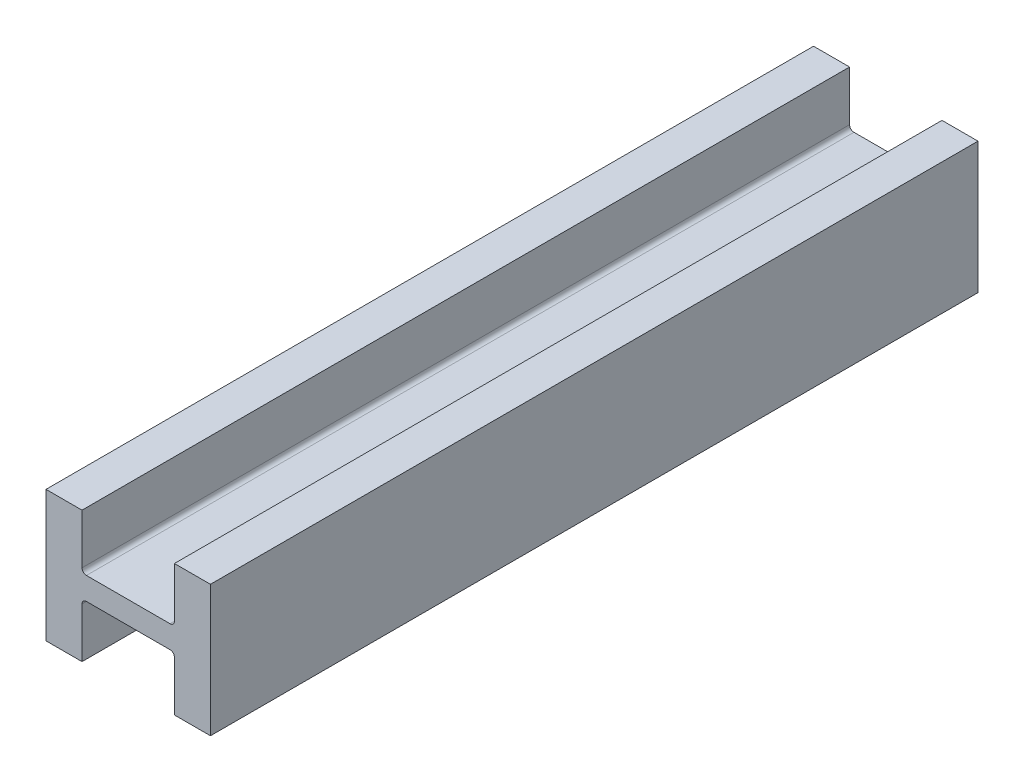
from build123d import *

# Parameters (mm, degrees)
BEAM_BODY_DEPTH = 1329.05


with BuildPart() as part:
    # sk W14x730 → Beam Body (new, symmetric)
    with BuildSketch(Plane(origin=(0, 0, 0), x_dir=(0, 1, 0), z_dir=(0, 0, 1))):
        with BuildLine():
            Line((-227.203, -284.734), (-227.203, -160.02))
            Line((-227.203, -160.02), (-54.229, -160.02))
            ThreePointArc((-54.229, -160.02), (-43.452692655, -155.556307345), (-38.989, -144.78))
            Line((-38.989, -144.78), (-38.989, 144.78))
            ThreePointArc((-38.989, 144.78), (-43.452692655, 155.556307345), (-54.229, 160.02))
            Line((-54.229, 160.02), (-227.203, 160.02))
            Line((-227.203, 160.02), (-227.203, 284.734))
            Line((-227.203, 284.734), (227.203, 284.734))
            Line((227.203, 284.734), (227.203, 160.02))
            Line((227.203, 160.02), (54.229, 160.02))
            ThreePointArc((54.229, 160.02), (43.452692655, 155.556307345), (38.989, 144.78))
            Line((38.989, 144.78), (38.989, -144.78))
            ThreePointArc((38.989, -144.78), (43.452692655, -155.556307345), (54.229, -160.02))
            Line((54.229, -160.02), (227.203, -160.02))
            Line((227.203, -160.02), (227.203, -284.734))
            Line((227.203, -284.734), (-227.203, -284.734))
        make_face()
    extrude(amount=BEAM_BODY_DEPTH, both=True)


solid = part.part
